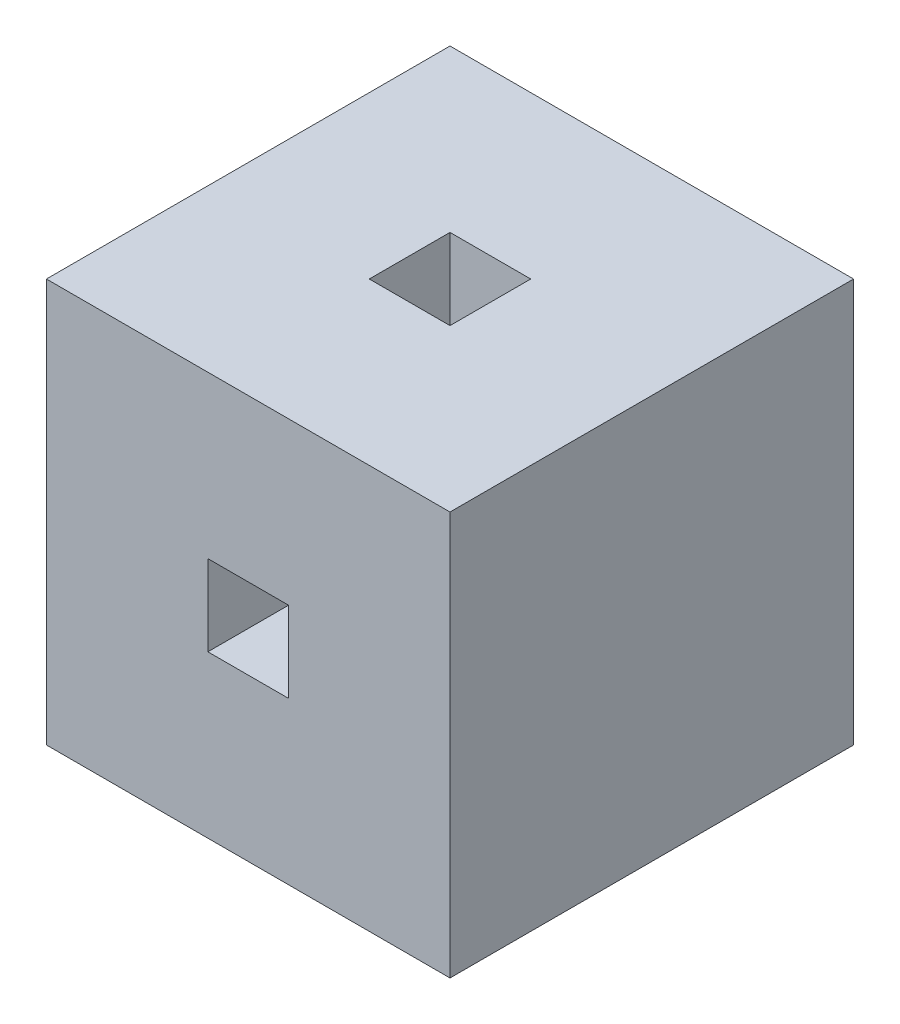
ISO-10303-21;
HEADER;
FILE_DESCRIPTION(('STEP AP214'),'2;1');
FILE_NAME('part.step','',(''),(''),'','','');
FILE_SCHEMA(('AUTOMOTIVE_DESIGN { 1 0 10303 214 1 1 1 1 }'));
ENDSEC;
DATA;
#1=APPLICATION_CONTEXT('core data for automotive mechanical design processes');
#2=APPLICATION_PROTOCOL_DEFINITION('international standard','automotive_design',2000,#1);
#3=PRODUCT_CONTEXT('',#1,'mechanical');
#4=PRODUCT('Part','Part','',(#3));
#5=PRODUCT_RELATED_PRODUCT_CATEGORY('part','',(#4));
#6=PRODUCT_DEFINITION_FORMATION('','',#4);
#7=PRODUCT_DEFINITION_CONTEXT('part definition',#1,'design');
#8=PRODUCT_DEFINITION('design','',#6,#7);
#9=PRODUCT_DEFINITION_SHAPE('','',#8);
#10=(LENGTH_UNIT() NAMED_UNIT(*) SI_UNIT(.MILLI.,.METRE.));
#11=(NAMED_UNIT(*) PLANE_ANGLE_UNIT() SI_UNIT($,.RADIAN.));
#12=(NAMED_UNIT(*) SI_UNIT($,.STERADIAN.) SOLID_ANGLE_UNIT());
#13=UNCERTAINTY_MEASURE_WITH_UNIT(LENGTH_MEASURE(1.E-05),#10,'distance_accuracy_value','');
#14=(GEOMETRIC_REPRESENTATION_CONTEXT(3) GLOBAL_UNCERTAINTY_ASSIGNED_CONTEXT((#13)) GLOBAL_UNIT_ASSIGNED_CONTEXT((#10,
#11,#12)) REPRESENTATION_CONTEXT('',''));
#15=CARTESIAN_POINT('',(0.,0.,0.));
#16=DIRECTION('',(0.,0.,1.));
#17=DIRECTION('',(1.,0.,0.));
#18=AXIS2_PLACEMENT_3D('',#15,#16,#17);
#19=CARTESIAN_POINT('',(-5.,-5.,-50.));
#20=DIRECTION('',(0.,-1.,0.));
#21=DIRECTION('',(0.,0.,-1.));
#22=AXIS2_PLACEMENT_3D('',#19,#20,#21);
#23=PLANE('',#22);
#24=DIRECTION('',(0.,0.,1.));
#25=VECTOR('',#24,1.);
#26=CARTESIAN_POINT('',(5.00000000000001,-5.,-50.));
#27=LINE('',#26,#25);
#28=CARTESIAN_POINT('',(5.,-5.,-20.));
#29=VERTEX_POINT('',#28);
#30=CARTESIAN_POINT('',(5.00000000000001,-5.,0.));
#31=VERTEX_POINT('',#30);
#32=EDGE_CURVE('E224',#29,#31,#27,.T.);
#33=ORIENTED_EDGE('',*,*,#32,.F.);
#34=DIRECTION('',(-1.,0.,0.));
#35=VECTOR('',#34,1.);
#36=CARTESIAN_POINT('',(-5.,-5.,-20.));
#37=LINE('',#36,#35);
#38=CARTESIAN_POINT('',(-5.,-5.,-20.));
#39=VERTEX_POINT('',#38);
#40=EDGE_CURVE('E194',#29,#39,#37,.T.);
#41=ORIENTED_EDGE('',*,*,#40,.T.);
#42=DIRECTION('',(0.,0.,1.));
#43=VECTOR('',#42,1.);
#44=CARTESIAN_POINT('',(-5.,-5.,-50.));
#45=LINE('',#44,#43);
#46=CARTESIAN_POINT('',(-5.,-5.,0.));
#47=VERTEX_POINT('',#46);
#48=EDGE_CURVE('E228',#39,#47,#45,.T.);
#49=ORIENTED_EDGE('',*,*,#48,.T.);
#50=DIRECTION('',(1.,0.,0.));
#51=VECTOR('',#50,1.);
#52=CARTESIAN_POINT('',(-5.,-5.,0.));
#53=LINE('',#52,#51);
#54=EDGE_CURVE('E202',#47,#31,#53,.T.);
#55=ORIENTED_EDGE('',*,*,#54,.T.);
#56=EDGE_LOOP('',(#33,#41,#49,#55));
#57=FACE_BOUND('',#56,.T.);
#58=ADVANCED_FACE('F33',(#57),#23,.F.);
#59=CARTESIAN_POINT('',(-5.,5.,-50.));
#60=DIRECTION('',(0.,1.,0.));
#61=DIRECTION('',(-1.,0.,0.));
#62=AXIS2_PLACEMENT_3D('',#59,#60,#61);
#63=PLANE('',#62);
#64=DIRECTION('',(0.,0.,1.));
#65=VECTOR('',#64,1.);
#66=CARTESIAN_POINT('',(-5.,5.,-50.));
#67=LINE('',#66,#65);
#68=CARTESIAN_POINT('',(-5.,5.,-20.));
#69=VERTEX_POINT('',#68);
#70=CARTESIAN_POINT('',(-5.,5.,0.));
#71=VERTEX_POINT('',#70);
#72=EDGE_CURVE('E232',#69,#71,#67,.T.);
#73=ORIENTED_EDGE('',*,*,#72,.F.);
#74=DIRECTION('',(1.,0.,0.));
#75=VECTOR('',#74,1.);
#76=CARTESIAN_POINT('',(-5.,5.,-20.));
#77=LINE('',#76,#75);
#78=CARTESIAN_POINT('',(5.,5.,-20.));
#79=VERTEX_POINT('',#78);
#80=EDGE_CURVE('E11',#69,#79,#77,.T.);
#81=ORIENTED_EDGE('',*,*,#80,.T.);
#82=DIRECTION('',(0.,0.,1.));
#83=VECTOR('',#82,1.);
#84=CARTESIAN_POINT('',(5.,5.,-50.));
#85=LINE('',#84,#83);
#86=CARTESIAN_POINT('',(5.,5.,0.));
#87=VERTEX_POINT('',#86);
#88=EDGE_CURVE('E211',#79,#87,#85,.T.);
#89=ORIENTED_EDGE('',*,*,#88,.T.);
#90=DIRECTION('',(-1.,0.,0.));
#91=VECTOR('',#90,1.);
#92=CARTESIAN_POINT('',(-5.,5.,0.));
#93=LINE('',#92,#91);
#94=EDGE_CURVE('E214',#87,#71,#93,.T.);
#95=ORIENTED_EDGE('',*,*,#94,.T.);
#96=EDGE_LOOP('',(#73,#81,#89,#95));
#97=FACE_BOUND('',#96,.T.);
#98=ADVANCED_FACE('F288',(#97),#63,.F.);
#99=CARTESIAN_POINT('',(25.,-25.,-50.));
#100=DIRECTION('',(1.,0.,0.));
#101=DIRECTION('',(0.,0.,-1.));
#102=AXIS2_PLACEMENT_3D('',#99,#100,#101);
#103=PLANE('',#102);
#104=DIRECTION('',(0.,1.,0.));
#105=VECTOR('',#104,1.);
#106=CARTESIAN_POINT('',(25.,-25.,0.));
#107=LINE('',#106,#105);
#108=CARTESIAN_POINT('',(25.,-25.,0.));
#109=VERTEX_POINT('',#108);
#110=CARTESIAN_POINT('',(25.,25.,0.));
#111=VERTEX_POINT('',#110);
#112=EDGE_CURVE('E223',#109,#111,#107,.T.);
#113=ORIENTED_EDGE('',*,*,#112,.F.);
#114=DIRECTION('',(0.,0.,1.));
#115=VECTOR('',#114,1.);
#116=CARTESIAN_POINT('',(25.,-25.,-50.));
#117=LINE('',#116,#115);
#118=CARTESIAN_POINT('',(25.,-25.,-50.));
#119=VERTEX_POINT('',#118);
#120=EDGE_CURVE('E260',#119,#109,#117,.T.);
#121=ORIENTED_EDGE('',*,*,#120,.F.);
#122=DIRECTION('',(0.,1.,0.));
#123=VECTOR('',#122,1.);
#124=CARTESIAN_POINT('',(25.,-25.,-50.));
#125=LINE('',#124,#123);
#126=CARTESIAN_POINT('',(25.,25.,-50.));
#127=VERTEX_POINT('',#126);
#128=EDGE_CURVE('E236',#119,#127,#125,.T.);
#129=ORIENTED_EDGE('',*,*,#128,.T.);
#130=DIRECTION('',(0.,0.,1.));
#131=VECTOR('',#130,1.);
#132=CARTESIAN_POINT('',(25.,25.,-50.));
#133=LINE('',#132,#131);
#134=EDGE_CURVE('E249',#127,#111,#133,.T.);
#135=ORIENTED_EDGE('',*,*,#134,.T.);
#136=EDGE_LOOP('',(#113,#121,#129,#135));
#137=FACE_BOUND('',#136,.T.);
#138=ADVANCED_FACE('F35',(#137),#103,.T.);
#139=CARTESIAN_POINT('',(-25.,-25.,-50.));
#140=DIRECTION('',(0.,-1.,0.));
#141=DIRECTION('',(0.,0.,-1.));
#142=AXIS2_PLACEMENT_3D('',#139,#140,#141);
#143=PLANE('',#142);
#144=DIRECTION('',(0.,0.,-1.));
#145=VECTOR('',#144,1.);
#146=CARTESIAN_POINT('',(5.,-25.,-20.));
#147=LINE('',#146,#145);
#148=CARTESIAN_POINT('',(5.,-25.,-20.));
#149=VERTEX_POINT('',#148);
#150=CARTESIAN_POINT('',(5.,-25.,-30.));
#151=VERTEX_POINT('',#150);
#152=EDGE_CURVE('E152',#149,#151,#147,.T.);
#153=ORIENTED_EDGE('',*,*,#152,.T.);
#154=DIRECTION('',(-1.,0.,0.));
#155=VECTOR('',#154,1.);
#156=CARTESIAN_POINT('',(-5.,-25.,-30.));
#157=LINE('',#156,#155);
#158=CARTESIAN_POINT('',(-5.,-25.,-30.));
#159=VERTEX_POINT('',#158);
#160=EDGE_CURVE('E162',#151,#159,#157,.T.);
#161=ORIENTED_EDGE('',*,*,#160,.T.);
#162=DIRECTION('',(0.,0.,1.));
#163=VECTOR('',#162,1.);
#164=CARTESIAN_POINT('',(-5.,-25.,-20.));
#165=LINE('',#164,#163);
#166=CARTESIAN_POINT('',(-5.,-25.,-20.));
#167=VERTEX_POINT('',#166);
#168=EDGE_CURVE('E48',#159,#167,#165,.T.);
#169=ORIENTED_EDGE('',*,*,#168,.T.);
#170=DIRECTION('',(1.,0.,0.));
#171=VECTOR('',#170,1.);
#172=CARTESIAN_POINT('',(-5.,-25.,-20.));
#173=LINE('',#172,#171);
#174=EDGE_CURVE('E170',#167,#149,#173,.T.);
#175=ORIENTED_EDGE('',*,*,#174,.T.);
#176=EDGE_LOOP('',(#153,#161,#169,#175));
#177=FACE_BOUND('',#176,.T.);
#178=DIRECTION('',(1.,0.,0.));
#179=VECTOR('',#178,1.);
#180=CARTESIAN_POINT('',(-25.,-25.,0.));
#181=LINE('',#180,#179);
#182=CARTESIAN_POINT('',(-25.,-25.,0.));
#183=VERTEX_POINT('',#182);
#184=EDGE_CURVE('E240',#183,#109,#181,.T.);
#185=ORIENTED_EDGE('',*,*,#184,.F.);
#186=DIRECTION('',(0.,0.,1.));
#187=VECTOR('',#186,1.);
#188=CARTESIAN_POINT('',(-25.,-25.,-50.));
#189=LINE('',#188,#187);
#190=CARTESIAN_POINT('',(-25.,-25.,-50.));
#191=VERTEX_POINT('',#190);
#192=EDGE_CURVE('E262',#191,#183,#189,.T.);
#193=ORIENTED_EDGE('',*,*,#192,.F.);
#194=DIRECTION('',(1.,0.,0.));
#195=VECTOR('',#194,1.);
#196=CARTESIAN_POINT('',(-25.,-25.,-50.));
#197=LINE('',#196,#195);
#198=EDGE_CURVE('E246',#191,#119,#197,.T.);
#199=ORIENTED_EDGE('',*,*,#198,.T.);
#200=ORIENTED_EDGE('',*,*,#120,.T.);
#201=EDGE_LOOP('',(#185,#193,#199,#200));
#202=FACE_BOUND('',#201,.T.);
#203=ADVANCED_FACE('F167',(#177,#202),#143,.T.);
#204=CARTESIAN_POINT('',(-25.,-25.,-50.));
#205=DIRECTION('',(-1.,0.,0.));
#206=DIRECTION('',(0.,0.,1.));
#207=AXIS2_PLACEMENT_3D('',#204,#205,#206);
#208=PLANE('',#207);
#209=DIRECTION('',(0.,-1.,0.));
#210=VECTOR('',#209,1.);
#211=CARTESIAN_POINT('',(-25.,-25.,0.));
#212=LINE('',#211,#210);
#213=CARTESIAN_POINT('',(-25.,25.,0.));
#214=VERTEX_POINT('',#213);
#215=EDGE_CURVE('E255',#214,#183,#212,.T.);
#216=ORIENTED_EDGE('',*,*,#215,.F.);
#217=DIRECTION('',(0.,0.,1.));
#218=VECTOR('',#217,1.);
#219=CARTESIAN_POINT('',(-25.,25.,-50.));
#220=LINE('',#219,#218);
#221=CARTESIAN_POINT('',(-25.,25.,-50.));
#222=VERTEX_POINT('',#221);
#223=EDGE_CURVE('E264',#222,#214,#220,.T.);
#224=ORIENTED_EDGE('',*,*,#223,.F.);
#225=DIRECTION('',(0.,-1.,0.));
#226=VECTOR('',#225,1.);
#227=CARTESIAN_POINT('',(-25.,-25.,-50.));
#228=LINE('',#227,#226);
#229=EDGE_CURVE('E243',#222,#191,#228,.T.);
#230=ORIENTED_EDGE('',*,*,#229,.T.);
#231=ORIENTED_EDGE('',*,*,#192,.T.);
#232=EDGE_LOOP('',(#216,#224,#230,#231));
#233=FACE_BOUND('',#232,.T.);
#234=ADVANCED_FACE('F334',(#233),#208,.T.);
#235=CARTESIAN_POINT('',(-25.,25.,-50.));
#236=DIRECTION('',(0.,1.,0.));
#237=DIRECTION('',(0.,0.,1.));
#238=AXIS2_PLACEMENT_3D('',#235,#236,#237);
#239=PLANE('',#238);
#240=DIRECTION('',(0.,0.,-1.));
#241=VECTOR('',#240,1.);
#242=CARTESIAN_POINT('',(5.,25.,-20.));
#243=LINE('',#242,#241);
#244=CARTESIAN_POINT('',(5.,25.,-20.));
#245=VERTEX_POINT('',#244);
#246=CARTESIAN_POINT('',(5.,25.,-30.));
#247=VERTEX_POINT('',#246);
#248=EDGE_CURVE('E56',#245,#247,#243,.T.);
#249=ORIENTED_EDGE('',*,*,#248,.F.);
#250=DIRECTION('',(1.,0.,0.));
#251=VECTOR('',#250,1.);
#252=CARTESIAN_POINT('',(-5.,25.,-20.));
#253=LINE('',#252,#251);
#254=CARTESIAN_POINT('',(-5.,25.,-20.));
#255=VERTEX_POINT('',#254);
#256=EDGE_CURVE('E171',#255,#245,#253,.T.);
#257=ORIENTED_EDGE('',*,*,#256,.F.);
#258=DIRECTION('',(0.,0.,1.));
#259=VECTOR('',#258,1.);
#260=CARTESIAN_POINT('',(-5.,25.,-20.));
#261=LINE('',#260,#259);
#262=CARTESIAN_POINT('',(-5.,25.,-30.));
#263=VERTEX_POINT('',#262);
#264=EDGE_CURVE('E174',#263,#255,#261,.T.);
#265=ORIENTED_EDGE('',*,*,#264,.F.);
#266=DIRECTION('',(-1.,0.,0.));
#267=VECTOR('',#266,1.);
#268=CARTESIAN_POINT('',(-5.,25.,-30.));
#269=LINE('',#268,#267);
#270=EDGE_CURVE('E180',#247,#263,#269,.T.);
#271=ORIENTED_EDGE('',*,*,#270,.F.);
#272=EDGE_LOOP('',(#249,#257,#265,#271));
#273=FACE_BOUND('',#272,.T.);
#274=DIRECTION('',(-1.,0.,0.));
#275=VECTOR('',#274,1.);
#276=CARTESIAN_POINT('',(-25.,25.,0.));
#277=LINE('',#276,#275);
#278=EDGE_CURVE('E252',#111,#214,#277,.T.);
#279=ORIENTED_EDGE('',*,*,#278,.F.);
#280=ORIENTED_EDGE('',*,*,#134,.F.);
#281=DIRECTION('',(-1.,0.,0.));
#282=VECTOR('',#281,1.);
#283=CARTESIAN_POINT('',(-25.,25.,-50.));
#284=LINE('',#283,#282);
#285=EDGE_CURVE('E239',#127,#222,#284,.T.);
#286=ORIENTED_EDGE('',*,*,#285,.T.);
#287=ORIENTED_EDGE('',*,*,#223,.T.);
#288=EDGE_LOOP('',(#279,#280,#286,#287));
#289=FACE_BOUND('',#288,.T.);
#290=ADVANCED_FACE('F281',(#273,#289),#239,.T.);
#291=CARTESIAN_POINT('',(25.,25.,-50.));
#292=DIRECTION('',(0.,0.,-1.));
#293=DIRECTION('',(-1.,0.,0.));
#294=AXIS2_PLACEMENT_3D('',#291,#292,#293);
#295=PLANE('',#294);
#296=DIRECTION('',(0.,1.,0.));
#297=VECTOR('',#296,1.);
#298=CARTESIAN_POINT('',(5.00000000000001,-5.,-50.));
#299=LINE('',#298,#297);
#300=CARTESIAN_POINT('',(5.00000000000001,-5.,-50.));
#301=VERTEX_POINT('',#300);
#302=CARTESIAN_POINT('',(5.,5.,-50.));
#303=VERTEX_POINT('',#302);
#304=EDGE_CURVE('E198',#301,#303,#299,.T.);
#305=ORIENTED_EDGE('',*,*,#304,.T.);
#306=DIRECTION('',(-1.,0.,0.));
#307=VECTOR('',#306,1.);
#308=CARTESIAN_POINT('',(-5.,5.,-50.));
#309=LINE('',#308,#307);
#310=CARTESIAN_POINT('',(-5.,5.,-50.));
#311=VERTEX_POINT('',#310);
#312=EDGE_CURVE('E201',#303,#311,#309,.T.);
#313=ORIENTED_EDGE('',*,*,#312,.T.);
#314=DIRECTION('',(0.,-1.,0.));
#315=VECTOR('',#314,1.);
#316=CARTESIAN_POINT('',(-5.,-5.,-50.));
#317=LINE('',#316,#315);
#318=CARTESIAN_POINT('',(-5.,-5.,-50.));
#319=VERTEX_POINT('',#318);
#320=EDGE_CURVE('E205',#311,#319,#317,.T.);
#321=ORIENTED_EDGE('',*,*,#320,.T.);
#322=DIRECTION('',(1.,0.,0.));
#323=VECTOR('',#322,1.);
#324=CARTESIAN_POINT('',(-5.,-5.,-50.));
#325=LINE('',#324,#323);
#326=EDGE_CURVE('E208',#319,#301,#325,.T.);
#327=ORIENTED_EDGE('',*,*,#326,.T.);
#328=EDGE_LOOP('',(#305,#313,#321,#327));
#329=FACE_BOUND('',#328,.T.);
#330=ORIENTED_EDGE('',*,*,#128,.F.);
#331=ORIENTED_EDGE('',*,*,#198,.F.);
#332=ORIENTED_EDGE('',*,*,#229,.F.);
#333=ORIENTED_EDGE('',*,*,#285,.F.);
#334=EDGE_LOOP('',(#330,#331,#332,#333));
#335=FACE_BOUND('',#334,.T.);
#336=ADVANCED_FACE('F275',(#329,#335),#295,.T.);
#337=CARTESIAN_POINT('',(25.,25.,0.));
#338=DIRECTION('',(0.,0.,-1.));
#339=DIRECTION('',(-1.,0.,0.));
#340=AXIS2_PLACEMENT_3D('',#337,#338,#339);
#341=PLANE('',#340);
#342=ORIENTED_EDGE('',*,*,#94,.F.);
#343=DIRECTION('',(0.,1.,0.));
#344=VECTOR('',#343,1.);
#345=CARTESIAN_POINT('',(5.00000000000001,-5.,0.));
#346=LINE('',#345,#344);
#347=EDGE_CURVE('E197',#31,#87,#346,.T.);
#348=ORIENTED_EDGE('',*,*,#347,.F.);
#349=ORIENTED_EDGE('',*,*,#54,.F.);
#350=DIRECTION('',(0.,-1.,0.));
#351=VECTOR('',#350,1.);
#352=CARTESIAN_POINT('',(-5.,-5.,0.));
#353=LINE('',#352,#351);
#354=EDGE_CURVE('E217',#71,#47,#353,.T.);
#355=ORIENTED_EDGE('',*,*,#354,.F.);
#356=EDGE_LOOP('',(#342,#348,#349,#355));
#357=FACE_BOUND('',#356,.T.);
#358=ORIENTED_EDGE('',*,*,#112,.T.);
#359=ORIENTED_EDGE('',*,*,#278,.T.);
#360=ORIENTED_EDGE('',*,*,#215,.T.);
#361=ORIENTED_EDGE('',*,*,#184,.T.);
#362=EDGE_LOOP('',(#358,#359,#360,#361));
#363=FACE_BOUND('',#362,.T.);
#364=ADVANCED_FACE('F295',(#357,#363),#341,.F.);
#365=CARTESIAN_POINT('',(5.00000000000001,-5.,-50.));
#366=DIRECTION('',(1.,0.,0.));
#367=DIRECTION('',(0.,1.,0.));
#368=AXIS2_PLACEMENT_3D('',#365,#366,#367);
#369=PLANE('',#368);
#370=CARTESIAN_POINT('',(5.00000000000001,-5.,-30.));
#371=VERTEX_POINT('',#370);
#372=EDGE_CURVE('E155',#301,#371,#27,.T.);
#373=ORIENTED_EDGE('',*,*,#372,.T.);
#374=DIRECTION('',(0.,1.,0.));
#375=VECTOR('',#374,1.);
#376=CARTESIAN_POINT('',(5.,-25.,-30.));
#377=LINE('',#376,#375);
#378=EDGE_CURVE('E147',#151,#371,#377,.T.);
#379=ORIENTED_EDGE('',*,*,#378,.F.);
#380=ORIENTED_EDGE('',*,*,#152,.F.);
#381=DIRECTION('',(0.,1.,0.));
#382=VECTOR('',#381,1.);
#383=CARTESIAN_POINT('',(5.,-25.,-20.));
#384=LINE('',#383,#382);
#385=EDGE_CURVE('E185',#149,#29,#384,.T.);
#386=ORIENTED_EDGE('',*,*,#385,.T.);
#387=ORIENTED_EDGE('',*,*,#32,.T.);
#388=ORIENTED_EDGE('',*,*,#347,.T.);
#389=ORIENTED_EDGE('',*,*,#88,.F.);
#390=EDGE_CURVE('E188',#79,#245,#384,.T.);
#391=ORIENTED_EDGE('',*,*,#390,.T.);
#392=ORIENTED_EDGE('',*,*,#248,.T.);
#393=CARTESIAN_POINT('',(5.,5.,-30.));
#394=VERTEX_POINT('',#393);
#395=EDGE_CURVE('E159',#394,#247,#377,.T.);
#396=ORIENTED_EDGE('',*,*,#395,.F.);
#397=EDGE_CURVE('E233',#303,#394,#85,.T.);
#398=ORIENTED_EDGE('',*,*,#397,.F.);
#399=ORIENTED_EDGE('',*,*,#304,.F.);
#400=EDGE_LOOP('',(#373,#379,#380,#386,#387,#388,#389,#391,#392,#396,#398,#399));
#401=FACE_BOUND('',#400,.T.);
#402=ADVANCED_FACE('F149',(#401),#369,.F.);
#403=CARTESIAN_POINT('',(-5.,-5.,-30.));
#404=VERTEX_POINT('',#403);
#405=EDGE_CURVE('E225',#319,#404,#45,.T.);
#406=ORIENTED_EDGE('',*,*,#405,.T.);
#407=DIRECTION('',(1.,0.,0.));
#408=VECTOR('',#407,1.);
#409=CARTESIAN_POINT('',(-5.,-5.,-30.));
#410=LINE('',#409,#408);
#411=EDGE_CURVE('E187',#404,#371,#410,.T.);
#412=ORIENTED_EDGE('',*,*,#411,.T.);
#413=ORIENTED_EDGE('',*,*,#372,.F.);
#414=ORIENTED_EDGE('',*,*,#326,.F.);
#415=EDGE_LOOP('',(#406,#412,#413,#414));
#416=FACE_BOUND('',#415,.T.);
#417=ADVANCED_FACE('F312',(#416),#23,.F.);
#418=CARTESIAN_POINT('',(-5.,-5.,-50.));
#419=DIRECTION('',(-1.,0.,0.));
#420=DIRECTION('',(0.,-1.,0.));
#421=AXIS2_PLACEMENT_3D('',#418,#419,#420);
#422=PLANE('',#421);
#423=CARTESIAN_POINT('',(-5.,5.,-30.));
#424=VERTEX_POINT('',#423);
#425=EDGE_CURVE('E229',#311,#424,#67,.T.);
#426=ORIENTED_EDGE('',*,*,#425,.T.);
#427=DIRECTION('',(0.,1.,0.));
#428=VECTOR('',#427,1.);
#429=CARTESIAN_POINT('',(-5.,-25.,-30.));
#430=LINE('',#429,#428);
#431=EDGE_CURVE('E158',#424,#263,#430,.T.);
#432=ORIENTED_EDGE('',*,*,#431,.T.);
#433=ORIENTED_EDGE('',*,*,#264,.T.);
#434=DIRECTION('',(0.,1.,0.));
#435=VECTOR('',#434,1.);
#436=CARTESIAN_POINT('',(-5.,-25.,-20.));
#437=LINE('',#436,#435);
#438=EDGE_CURVE('E191',#69,#255,#437,.T.);
#439=ORIENTED_EDGE('',*,*,#438,.F.);
#440=ORIENTED_EDGE('',*,*,#72,.T.);
#441=ORIENTED_EDGE('',*,*,#354,.T.);
#442=ORIENTED_EDGE('',*,*,#48,.F.);
#443=EDGE_CURVE('E189',#167,#39,#437,.T.);
#444=ORIENTED_EDGE('',*,*,#443,.F.);
#445=ORIENTED_EDGE('',*,*,#168,.F.);
#446=EDGE_CURVE('E164',#159,#404,#430,.T.);
#447=ORIENTED_EDGE('',*,*,#446,.T.);
#448=ORIENTED_EDGE('',*,*,#405,.F.);
#449=ORIENTED_EDGE('',*,*,#320,.F.);
#450=EDGE_LOOP('',(#426,#432,#433,#439,#440,#441,#442,#444,#445,#447,#448,#449));
#451=FACE_BOUND('',#450,.T.);
#452=ADVANCED_FACE('F272',(#451),#422,.F.);
#453=ORIENTED_EDGE('',*,*,#397,.T.);
#454=DIRECTION('',(-1.,0.,0.));
#455=VECTOR('',#454,1.);
#456=CARTESIAN_POINT('',(-5.,5.,-30.));
#457=LINE('',#456,#455);
#458=EDGE_CURVE('E41',#394,#424,#457,.T.);
#459=ORIENTED_EDGE('',*,*,#458,.T.);
#460=ORIENTED_EDGE('',*,*,#425,.F.);
#461=ORIENTED_EDGE('',*,*,#312,.F.);
#462=EDGE_LOOP('',(#453,#459,#460,#461));
#463=FACE_BOUND('',#462,.T.);
#464=ADVANCED_FACE('F269',(#463),#63,.F.);
#465=CARTESIAN_POINT('',(-5.,-25.,-30.));
#466=DIRECTION('',(0.,0.,-1.));
#467=DIRECTION('',(-1.,0.,0.));
#468=AXIS2_PLACEMENT_3D('',#465,#466,#467);
#469=PLANE('',#468);
#470=ORIENTED_EDGE('',*,*,#395,.T.);
#471=ORIENTED_EDGE('',*,*,#270,.T.);
#472=ORIENTED_EDGE('',*,*,#431,.F.);
#473=ORIENTED_EDGE('',*,*,#458,.F.);
#474=EDGE_LOOP('',(#470,#471,#472,#473));
#475=FACE_BOUND('',#474,.T.);
#476=ADVANCED_FACE('F278',(#475),#469,.F.);
#477=CARTESIAN_POINT('',(-5.,-25.,-20.));
#478=DIRECTION('',(0.,0.,1.));
#479=DIRECTION('',(1.,0.,0.));
#480=AXIS2_PLACEMENT_3D('',#477,#478,#479);
#481=PLANE('',#480);
#482=ORIENTED_EDGE('',*,*,#438,.T.);
#483=ORIENTED_EDGE('',*,*,#256,.T.);
#484=ORIENTED_EDGE('',*,*,#390,.F.);
#485=ORIENTED_EDGE('',*,*,#80,.F.);
#486=EDGE_LOOP('',(#482,#483,#484,#485));
#487=FACE_BOUND('',#486,.T.);
#488=ADVANCED_FACE('F302',(#487),#481,.F.);
#489=ORIENTED_EDGE('',*,*,#385,.F.);
#490=ORIENTED_EDGE('',*,*,#174,.F.);
#491=ORIENTED_EDGE('',*,*,#443,.T.);
#492=ORIENTED_EDGE('',*,*,#40,.F.);
#493=EDGE_LOOP('',(#489,#490,#491,#492));
#494=FACE_BOUND('',#493,.T.);
#495=ADVANCED_FACE('F301',(#494),#481,.F.);
#496=ORIENTED_EDGE('',*,*,#446,.F.);
#497=ORIENTED_EDGE('',*,*,#160,.F.);
#498=ORIENTED_EDGE('',*,*,#378,.T.);
#499=ORIENTED_EDGE('',*,*,#411,.F.);
#500=EDGE_LOOP('',(#496,#497,#498,#499));
#501=FACE_BOUND('',#500,.T.);
#502=ADVANCED_FACE('F163',(#501),#469,.F.);
#503=CLOSED_SHELL('',(#58,#98,#138,#203,#234,#290,#336,#364,#402,#417,#452,#464,#476,#488,#495,#502));
#504=MANIFOLD_SOLID_BREP('B2',#503);
#505=ADVANCED_BREP_SHAPE_REPRESENTATION('',(#18,#504),#14);
#506=SHAPE_DEFINITION_REPRESENTATION(#9,#505);
ENDSEC;
END-ISO-10303-21;
